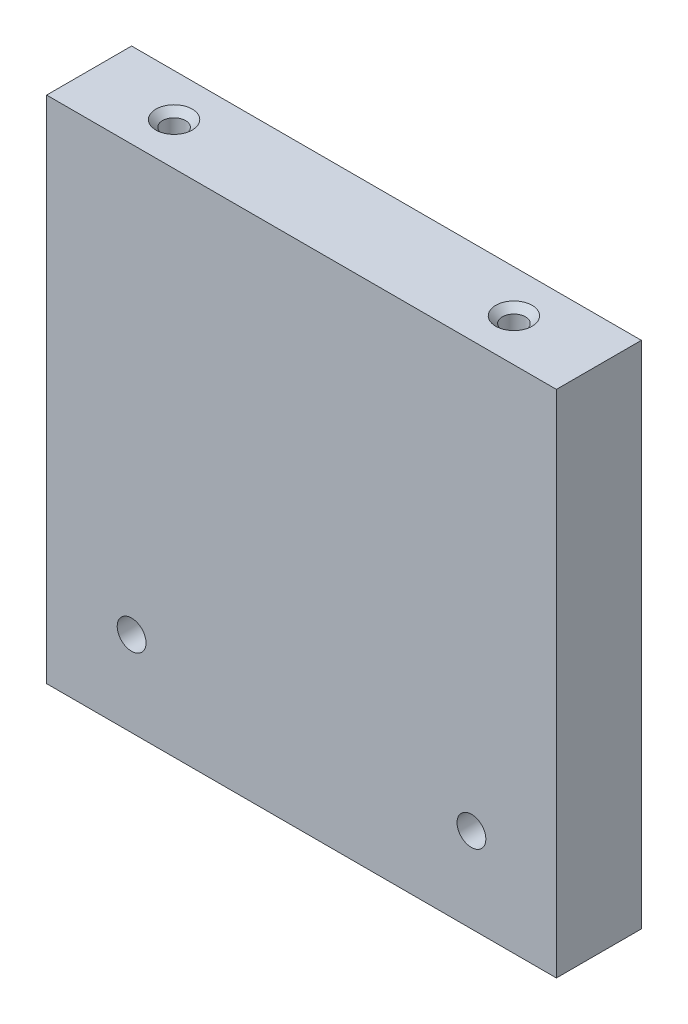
ISO-10303-21;
HEADER;
FILE_DESCRIPTION(('STEP AP214'),'2;1');
FILE_NAME('part.step','',(''),(''),'','','');
FILE_SCHEMA(('AUTOMOTIVE_DESIGN { 1 0 10303 214 1 1 1 1 }'));
ENDSEC;
DATA;
#1=APPLICATION_CONTEXT('core data for automotive mechanical design processes');
#2=APPLICATION_PROTOCOL_DEFINITION('international standard','automotive_design',2000,#1);
#3=PRODUCT_CONTEXT('',#1,'mechanical');
#4=PRODUCT('Part','Part','',(#3));
#5=PRODUCT_RELATED_PRODUCT_CATEGORY('part','',(#4));
#6=PRODUCT_DEFINITION_FORMATION('','',#4);
#7=PRODUCT_DEFINITION_CONTEXT('part definition',#1,'design');
#8=PRODUCT_DEFINITION('design','',#6,#7);
#9=PRODUCT_DEFINITION_SHAPE('','',#8);
#10=(LENGTH_UNIT() NAMED_UNIT(*) SI_UNIT(.MILLI.,.METRE.));
#11=(NAMED_UNIT(*) PLANE_ANGLE_UNIT() SI_UNIT($,.RADIAN.));
#12=(NAMED_UNIT(*) SI_UNIT($,.STERADIAN.) SOLID_ANGLE_UNIT());
#13=UNCERTAINTY_MEASURE_WITH_UNIT(LENGTH_MEASURE(1.E-05),#10,'distance_accuracy_value','');
#14=(GEOMETRIC_REPRESENTATION_CONTEXT(3) GLOBAL_UNCERTAINTY_ASSIGNED_CONTEXT((#13)) GLOBAL_UNIT_ASSIGNED_CONTEXT((#10,
#11,#12)) REPRESENTATION_CONTEXT('',''));
#15=CARTESIAN_POINT('',(0.,0.,0.));
#16=DIRECTION('',(0.,0.,1.));
#17=DIRECTION('',(1.,0.,0.));
#18=AXIS2_PLACEMENT_3D('',#15,#16,#17);
#19=CARTESIAN_POINT('',(-83.6106791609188,-14.4887323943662,12.7));
#20=DIRECTION('',(0.,1.,0.));
#21=DIRECTION('',(0.,0.,1.));
#22=AXIS2_PLACEMENT_3D('',#19,#20,#21);
#23=PLANE('',#22);
#24=DIRECTION('',(1.,0.,0.));
#25=VECTOR('',#24,1.);
#26=CARTESIAN_POINT('',(-83.6106791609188,-14.4887323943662,0.));
#27=LINE('',#26,#25);
#28=CARTESIAN_POINT('',(-83.6106791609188,-14.4887323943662,0.));
#29=VERTEX_POINT('',#28);
#30=CARTESIAN_POINT('',(-7.41067916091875,-14.4887323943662,0.));
#31=VERTEX_POINT('',#30);
#32=EDGE_CURVE('E124',#29,#31,#27,.T.);
#33=ORIENTED_EDGE('',*,*,#32,.T.);
#34=DIRECTION('',(0.,0.,-1.));
#35=VECTOR('',#34,1.);
#36=CARTESIAN_POINT('',(-7.41067916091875,-14.4887323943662,12.7));
#37=LINE('',#36,#35);
#38=CARTESIAN_POINT('',(-7.41067916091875,-14.4887323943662,12.7));
#39=VERTEX_POINT('',#38);
#40=EDGE_CURVE('E11',#39,#31,#37,.T.);
#41=ORIENTED_EDGE('',*,*,#40,.F.);
#42=DIRECTION('',(1.,0.,0.));
#43=VECTOR('',#42,1.);
#44=CARTESIAN_POINT('',(-83.6106791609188,-14.4887323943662,12.7));
#45=LINE('',#44,#43);
#46=CARTESIAN_POINT('',(-83.6106791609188,-14.4887323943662,12.7));
#47=VERTEX_POINT('',#46);
#48=EDGE_CURVE('E83',#47,#39,#45,.T.);
#49=ORIENTED_EDGE('',*,*,#48,.F.);
#50=DIRECTION('',(0.,0.,-1.));
#51=VECTOR('',#50,1.);
#52=CARTESIAN_POINT('',(-83.6106791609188,-14.4887323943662,12.7));
#53=LINE('',#52,#51);
#54=EDGE_CURVE('E137',#47,#29,#53,.T.);
#55=ORIENTED_EDGE('',*,*,#54,.T.);
#56=EDGE_LOOP('',(#33,#41,#49,#55));
#57=FACE_BOUND('',#56,.T.);
#58=ADVANCED_FACE('F42',(#57),#23,.F.);
#59=CARTESIAN_POINT('',(-7.41067916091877,61.7112676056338,12.7));
#60=DIRECTION('',(1.,0.,0.));
#61=DIRECTION('',(0.,1.,0.));
#62=AXIS2_PLACEMENT_3D('',#59,#60,#61);
#63=PLANE('',#62);
#64=DIRECTION('',(0.,-1.,0.));
#65=VECTOR('',#64,1.);
#66=CARTESIAN_POINT('',(-7.41067916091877,61.7112676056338,0.));
#67=LINE('',#66,#65);
#68=CARTESIAN_POINT('',(-7.41067916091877,61.7112676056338,0.));
#69=VERTEX_POINT('',#68);
#70=EDGE_CURVE('E141',#69,#31,#67,.T.);
#71=ORIENTED_EDGE('',*,*,#70,.F.);
#72=DIRECTION('',(0.,0.,-1.));
#73=VECTOR('',#72,1.);
#74=CARTESIAN_POINT('',(-7.41067916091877,61.7112676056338,12.7));
#75=LINE('',#74,#73);
#76=CARTESIAN_POINT('',(-7.41067916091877,61.7112676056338,12.7));
#77=VERTEX_POINT('',#76);
#78=EDGE_CURVE('E51',#77,#69,#75,.T.);
#79=ORIENTED_EDGE('',*,*,#78,.F.);
#80=DIRECTION('',(0.,-1.,0.));
#81=VECTOR('',#80,1.);
#82=CARTESIAN_POINT('',(-7.41067916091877,61.7112676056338,12.7));
#83=LINE('',#82,#81);
#84=EDGE_CURVE('E127',#77,#39,#83,.T.);
#85=ORIENTED_EDGE('',*,*,#84,.T.);
#86=ORIENTED_EDGE('',*,*,#40,.T.);
#87=EDGE_LOOP('',(#71,#79,#85,#86));
#88=FACE_BOUND('',#87,.T.);
#89=ADVANCED_FACE('F161',(#88),#63,.T.);
#90=CARTESIAN_POINT('',(-83.6106791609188,61.7112676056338,12.7));
#91=DIRECTION('',(0.,1.,0.));
#92=DIRECTION('',(0.,0.,1.));
#93=AXIS2_PLACEMENT_3D('',#90,#91,#92);
#94=PLANE('',#93);
#95=CARTESIAN_POINT('',(-70.9106791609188,61.7112676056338,6.35));
#96=DIRECTION('',(0.,1.,0.));
#97=DIRECTION('',(0.,0.,1.));
#98=AXIS2_PLACEMENT_3D('',#95,#96,#97);
#99=CIRCLE('',#98,2.71780000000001);
#100=CARTESIAN_POINT('',(-70.9106791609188,61.7112676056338,9.06780000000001));
#101=VERTEX_POINT('',#100);
#102=EDGE_CURVE('E113',#101,#101,#99,.T.);
#103=ORIENTED_EDGE('',*,*,#102,.F.);
#104=EDGE_LOOP('',(#103));
#105=FACE_BOUND('',#104,.T.);
#106=CARTESIAN_POINT('',(-20.1106791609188,61.7112676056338,6.35));
#107=DIRECTION('',(0.,1.,0.));
#108=DIRECTION('',(0.,0.,1.));
#109=AXIS2_PLACEMENT_3D('',#106,#107,#108);
#110=CIRCLE('',#109,2.7178);
#111=CARTESIAN_POINT('',(-20.1106791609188,61.7112676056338,9.0678));
#112=VERTEX_POINT('',#111);
#113=EDGE_CURVE('E103',#112,#112,#110,.T.);
#114=ORIENTED_EDGE('',*,*,#113,.F.);
#115=EDGE_LOOP('',(#114));
#116=FACE_BOUND('',#115,.T.);
#117=DIRECTION('',(1.,0.,0.));
#118=VECTOR('',#117,1.);
#119=CARTESIAN_POINT('',(-83.6106791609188,61.7112676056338,0.));
#120=LINE('',#119,#118);
#121=CARTESIAN_POINT('',(-83.6106791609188,61.7112676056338,0.));
#122=VERTEX_POINT('',#121);
#123=EDGE_CURVE('E145',#122,#69,#120,.T.);
#124=ORIENTED_EDGE('',*,*,#123,.F.);
#125=DIRECTION('',(0.,0.,-1.));
#126=VECTOR('',#125,1.);
#127=CARTESIAN_POINT('',(-83.6106791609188,61.7112676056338,12.7));
#128=LINE('',#127,#126);
#129=CARTESIAN_POINT('',(-83.6106791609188,61.7112676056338,12.7));
#130=VERTEX_POINT('',#129);
#131=EDGE_CURVE('E75',#130,#122,#128,.T.);
#132=ORIENTED_EDGE('',*,*,#131,.F.);
#133=DIRECTION('',(1.,0.,0.));
#134=VECTOR('',#133,1.);
#135=CARTESIAN_POINT('',(-83.6106791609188,61.7112676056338,12.7));
#136=LINE('',#135,#134);
#137=EDGE_CURVE('E131',#130,#77,#136,.T.);
#138=ORIENTED_EDGE('',*,*,#137,.T.);
#139=ORIENTED_EDGE('',*,*,#78,.T.);
#140=EDGE_LOOP('',(#124,#132,#138,#139));
#141=FACE_BOUND('',#140,.T.);
#142=ADVANCED_FACE('F159',(#105,#116,#141),#94,.T.);
#143=CARTESIAN_POINT('',(-83.6106791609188,61.7112676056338,12.7));
#144=DIRECTION('',(1.,0.,0.));
#145=DIRECTION('',(0.,0.,-1.));
#146=AXIS2_PLACEMENT_3D('',#143,#144,#145);
#147=PLANE('',#146);
#148=DIRECTION('',(0.,-1.,0.));
#149=VECTOR('',#148,1.);
#150=CARTESIAN_POINT('',(-83.6106791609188,61.7112676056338,0.));
#151=LINE('',#150,#149);
#152=EDGE_CURVE('E78',#122,#29,#151,.T.);
#153=ORIENTED_EDGE('',*,*,#152,.T.);
#154=ORIENTED_EDGE('',*,*,#54,.F.);
#155=DIRECTION('',(0.,-1.,0.));
#156=VECTOR('',#155,1.);
#157=CARTESIAN_POINT('',(-83.6106791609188,61.7112676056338,12.7));
#158=LINE('',#157,#156);
#159=EDGE_CURVE('E59',#130,#47,#158,.T.);
#160=ORIENTED_EDGE('',*,*,#159,.F.);
#161=ORIENTED_EDGE('',*,*,#131,.T.);
#162=EDGE_LOOP('',(#153,#154,#160,#161));
#163=FACE_BOUND('',#162,.T.);
#164=ADVANCED_FACE('F166',(#163),#147,.F.);
#165=CARTESIAN_POINT('',(0.,0.,12.7));
#166=DIRECTION('',(0.,0.,-1.));
#167=DIRECTION('',(-1.,0.,0.));
#168=AXIS2_PLACEMENT_3D('',#165,#166,#167);
#169=PLANE('',#168);
#170=CARTESIAN_POINT('',(-20.1106791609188,-1.78873239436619,12.7));
#171=DIRECTION('',(0.,0.,-1.));
#172=DIRECTION('',(-1.,0.,0.));
#173=AXIS2_PLACEMENT_3D('',#170,#171,#172);
#174=CIRCLE('',#173,2.15265);
#175=CARTESIAN_POINT('',(-22.2633291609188,-1.78873239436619,12.7));
#176=VERTEX_POINT('',#175);
#177=EDGE_CURVE('E442',#176,#176,#174,.T.);
#178=ORIENTED_EDGE('',*,*,#177,.T.);
#179=EDGE_LOOP('',(#178));
#180=FACE_BOUND('',#179,.T.);
#181=CARTESIAN_POINT('',(-70.9106791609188,-1.78873239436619,12.7));
#182=DIRECTION('',(0.,0.,-1.));
#183=DIRECTION('',(-1.,0.,0.));
#184=AXIS2_PLACEMENT_3D('',#181,#182,#183);
#185=CIRCLE('',#184,2.15264999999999);
#186=CARTESIAN_POINT('',(-73.0633291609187,-1.78873239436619,12.7));
#187=VERTEX_POINT('',#186);
#188=EDGE_CURVE('E461',#187,#187,#185,.T.);
#189=ORIENTED_EDGE('',*,*,#188,.T.);
#190=EDGE_LOOP('',(#189));
#191=FACE_BOUND('',#190,.T.);
#192=ORIENTED_EDGE('',*,*,#48,.T.);
#193=ORIENTED_EDGE('',*,*,#84,.F.);
#194=ORIENTED_EDGE('',*,*,#137,.F.);
#195=ORIENTED_EDGE('',*,*,#159,.T.);
#196=EDGE_LOOP('',(#192,#193,#194,#195));
#197=FACE_BOUND('',#196,.T.);
#198=ADVANCED_FACE('F167',(#180,#191,#197),#169,.F.);
#199=CARTESIAN_POINT('',(0.,0.,0.));
#200=DIRECTION('',(0.,0.,-1.));
#201=DIRECTION('',(-1.,0.,0.));
#202=AXIS2_PLACEMENT_3D('',#199,#200,#201);
#203=PLANE('',#202);
#204=CARTESIAN_POINT('',(-20.1106791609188,-1.78873239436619,0.));
#205=DIRECTION('',(0.,0.,-1.));
#206=DIRECTION('',(-1.,0.,0.));
#207=AXIS2_PLACEMENT_3D('',#204,#205,#206);
#208=CIRCLE('',#207,4.60375);
#209=CARTESIAN_POINT('',(-24.7144291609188,-1.78873239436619,0.));
#210=VERTEX_POINT('',#209);
#211=EDGE_CURVE('E427',#210,#210,#208,.T.);
#212=ORIENTED_EDGE('',*,*,#211,.F.);
#213=EDGE_LOOP('',(#212));
#214=FACE_BOUND('',#213,.T.);
#215=CARTESIAN_POINT('',(-70.9106791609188,-1.78873239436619,0.));
#216=DIRECTION('',(0.,0.,-1.));
#217=DIRECTION('',(-1.,0.,0.));
#218=AXIS2_PLACEMENT_3D('',#215,#216,#217);
#219=CIRCLE('',#218,4.60375);
#220=CARTESIAN_POINT('',(-75.5144291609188,-1.78873239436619,0.));
#221=VERTEX_POINT('',#220);
#222=EDGE_CURVE('E445',#221,#221,#219,.T.);
#223=ORIENTED_EDGE('',*,*,#222,.F.);
#224=EDGE_LOOP('',(#223));
#225=FACE_BOUND('',#224,.T.);
#226=ORIENTED_EDGE('',*,*,#32,.F.);
#227=ORIENTED_EDGE('',*,*,#152,.F.);
#228=ORIENTED_EDGE('',*,*,#123,.T.);
#229=ORIENTED_EDGE('',*,*,#70,.T.);
#230=EDGE_LOOP('',(#226,#227,#228,#229));
#231=FACE_BOUND('',#230,.T.);
#232=ADVANCED_FACE('F164',(#214,#225,#231),#203,.T.);
#233=CARTESIAN_POINT('',(-20.1106791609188,55.3612676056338,6.35));
#234=DIRECTION('',(0.,1.,0.));
#235=DIRECTION('',(0.,0.,1.));
#236=AXIS2_PLACEMENT_3D('',#233,#234,#235);
#237=CONICAL_SURFACE('',#236,1.7272,1.02974425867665);
#238=CARTESIAN_POINT('',(-20.1106791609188,54.3234611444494,6.35));
#239=VERTEX_POINT('',#238);
#240=VERTEX_LOOP('',#239);
#241=FACE_BOUND('',#240,.T.);
#242=CARTESIAN_POINT('',(-20.1106791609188,55.3612676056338,6.35));
#243=DIRECTION('',(0.,1.,0.));
#244=DIRECTION('',(0.,0.,1.));
#245=AXIS2_PLACEMENT_3D('',#242,#243,#244);
#246=CIRCLE('',#245,1.7272);
#247=CARTESIAN_POINT('',(-20.1106791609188,55.3612676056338,8.0772));
#248=VERTEX_POINT('',#247);
#249=EDGE_CURVE('E120',#248,#248,#246,.T.);
#250=ORIENTED_EDGE('',*,*,#249,.T.);
#251=EDGE_LOOP('',(#250));
#252=FACE_BOUND('',#251,.T.);
#253=ADVANCED_FACE('F175',(#241,#252),#237,.F.);
#254=CARTESIAN_POINT('',(-20.1106791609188,61.7112676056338,6.35));
#255=DIRECTION('',(0.,1.,0.));
#256=DIRECTION('',(0.,0.,1.));
#257=AXIS2_PLACEMENT_3D('',#254,#255,#256);
#258=CYLINDRICAL_SURFACE('',#257,1.7272);
#259=ORIENTED_EDGE('',*,*,#249,.F.);
#260=EDGE_LOOP('',(#259));
#261=FACE_BOUND('',#260,.T.);
#262=CARTESIAN_POINT('',(-20.1106791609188,60.7206676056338,6.35));
#263=DIRECTION('',(0.,1.,0.));
#264=DIRECTION('',(0.,0.,1.));
#265=AXIS2_PLACEMENT_3D('',#262,#263,#264);
#266=CIRCLE('',#265,1.7272);
#267=CARTESIAN_POINT('',(-20.1106791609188,60.7206676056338,8.0772));
#268=VERTEX_POINT('',#267);
#269=EDGE_CURVE('E110',#268,#268,#266,.T.);
#270=ORIENTED_EDGE('',*,*,#269,.T.);
#271=EDGE_LOOP('',(#270));
#272=FACE_BOUND('',#271,.T.);
#273=ADVANCED_FACE('F199',(#261,#272),#258,.F.);
#274=CARTESIAN_POINT('',(-20.1106791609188,61.7112676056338,6.35));
#275=DIRECTION('',(0.,1.,0.));
#276=DIRECTION('',(0.,0.,1.));
#277=AXIS2_PLACEMENT_3D('',#274,#275,#276);
#278=CONICAL_SURFACE('',#277,2.7178,0.785398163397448);
#279=ORIENTED_EDGE('',*,*,#269,.F.);
#280=EDGE_LOOP('',(#279));
#281=FACE_BOUND('',#280,.T.);
#282=ORIENTED_EDGE('',*,*,#113,.T.);
#283=EDGE_LOOP('',(#282));
#284=FACE_BOUND('',#283,.T.);
#285=ADVANCED_FACE('F96',(#281,#284),#278,.F.);
#286=CARTESIAN_POINT('',(-70.9106791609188,55.3612676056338,6.35));
#287=DIRECTION('',(0.,1.,0.));
#288=DIRECTION('',(0.,0.,1.));
#289=AXIS2_PLACEMENT_3D('',#286,#287,#288);
#290=CONICAL_SURFACE('',#289,1.7272,1.02974425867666);
#291=CARTESIAN_POINT('',(-70.9106791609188,54.3234611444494,6.35));
#292=VERTEX_POINT('',#291);
#293=VERTEX_LOOP('',#292);
#294=FACE_BOUND('',#293,.T.);
#295=CARTESIAN_POINT('',(-70.9106791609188,55.3612676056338,6.35));
#296=DIRECTION('',(0.,1.,0.));
#297=DIRECTION('',(0.,0.,1.));
#298=AXIS2_PLACEMENT_3D('',#295,#296,#297);
#299=CIRCLE('',#298,1.7272);
#300=CARTESIAN_POINT('',(-70.9106791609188,55.3612676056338,8.0772));
#301=VERTEX_POINT('',#300);
#302=EDGE_CURVE('E100',#301,#301,#299,.T.);
#303=ORIENTED_EDGE('',*,*,#302,.T.);
#304=EDGE_LOOP('',(#303));
#305=FACE_BOUND('',#304,.T.);
#306=ADVANCED_FACE('F92',(#294,#305),#290,.F.);
#307=CARTESIAN_POINT('',(-70.9106791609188,61.7112676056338,6.35));
#308=DIRECTION('',(0.,1.,0.));
#309=DIRECTION('',(0.,0.,1.));
#310=AXIS2_PLACEMENT_3D('',#307,#308,#309);
#311=CYLINDRICAL_SURFACE('',#310,1.7272);
#312=ORIENTED_EDGE('',*,*,#302,.F.);
#313=EDGE_LOOP('',(#312));
#314=FACE_BOUND('',#313,.T.);
#315=CARTESIAN_POINT('',(-70.9106791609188,60.7206676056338,6.35));
#316=DIRECTION('',(0.,1.,0.));
#317=DIRECTION('',(0.,0.,1.));
#318=AXIS2_PLACEMENT_3D('',#315,#316,#317);
#319=CIRCLE('',#318,1.7272);
#320=CARTESIAN_POINT('',(-70.9106791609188,60.7206676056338,8.0772));
#321=VERTEX_POINT('',#320);
#322=EDGE_CURVE('E104',#321,#321,#319,.T.);
#323=ORIENTED_EDGE('',*,*,#322,.T.);
#324=EDGE_LOOP('',(#323));
#325=FACE_BOUND('',#324,.T.);
#326=ADVANCED_FACE('F95',(#314,#325),#311,.F.);
#327=CARTESIAN_POINT('',(-70.9106791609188,61.7112676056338,6.35));
#328=DIRECTION('',(0.,1.,0.));
#329=DIRECTION('',(0.,0.,1.));
#330=AXIS2_PLACEMENT_3D('',#327,#328,#329);
#331=CONICAL_SURFACE('',#330,2.71780000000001,0.785398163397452);
#332=ORIENTED_EDGE('',*,*,#322,.F.);
#333=EDGE_LOOP('',(#332));
#334=FACE_BOUND('',#333,.T.);
#335=ORIENTED_EDGE('',*,*,#102,.T.);
#336=EDGE_LOOP('',(#335));
#337=FACE_BOUND('',#336,.T.);
#338=ADVANCED_FACE('F244',(#334,#337),#331,.F.);
#339=CARTESIAN_POINT('',(-70.9106791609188,-1.78873239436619,0.));
#340=DIRECTION('',(0.,0.,-1.));
#341=DIRECTION('',(-1.,0.,0.));
#342=AXIS2_PLACEMENT_3D('',#339,#340,#341);
#343=CYLINDRICAL_SURFACE('',#342,2.15265);
#344=ORIENTED_EDGE('',*,*,#188,.F.);
#345=EDGE_LOOP('',(#344));
#346=FACE_BOUND('',#345,.T.);
#347=CARTESIAN_POINT('',(-70.9106791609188,-1.78873239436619,4.1656));
#348=DIRECTION('',(0.,0.,-1.));
#349=DIRECTION('',(-1.,0.,0.));
#350=AXIS2_PLACEMENT_3D('',#347,#348,#349);
#351=CIRCLE('',#350,2.15265000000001);
#352=CARTESIAN_POINT('',(-73.0633291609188,-1.78873239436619,4.1656));
#353=VERTEX_POINT('',#352);
#354=EDGE_CURVE('E457',#353,#353,#351,.T.);
#355=ORIENTED_EDGE('',*,*,#354,.T.);
#356=EDGE_LOOP('',(#355));
#357=FACE_BOUND('',#356,.T.);
#358=ADVANCED_FACE('F252',(#346,#357),#343,.F.);
#359=CARTESIAN_POINT('',(-66.9419291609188,-1.78873239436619,4.1656));
#360=DIRECTION('',(0.,0.,1.));
#361=DIRECTION('',(1.,0.,0.));
#362=AXIS2_PLACEMENT_3D('',#359,#360,#361);
#363=PLANE('',#362);
#364=ORIENTED_EDGE('',*,*,#354,.F.);
#365=EDGE_LOOP('',(#364));
#366=FACE_BOUND('',#365,.T.);
#367=CARTESIAN_POINT('',(-70.9106791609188,-1.78873239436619,4.1656));
#368=DIRECTION('',(0.,0.,-1.));
#369=DIRECTION('',(-1.,0.,0.));
#370=AXIS2_PLACEMENT_3D('',#367,#368,#369);
#371=CIRCLE('',#370,3.96874999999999);
#372=CARTESIAN_POINT('',(-74.8794291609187,-1.78873239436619,4.1656));
#373=VERTEX_POINT('',#372);
#374=EDGE_CURVE('E453',#373,#373,#371,.T.);
#375=ORIENTED_EDGE('',*,*,#374,.T.);
#376=EDGE_LOOP('',(#375));
#377=FACE_BOUND('',#376,.T.);
#378=ADVANCED_FACE('F262',(#366,#377),#363,.F.);
#379=CARTESIAN_POINT('',(-70.9106791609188,-1.78873239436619,0.));
#380=DIRECTION('',(0.,0.,-1.));
#381=DIRECTION('',(-1.,0.,0.));
#382=AXIS2_PLACEMENT_3D('',#379,#380,#381);
#383=CYLINDRICAL_SURFACE('',#382,3.96874999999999);
#384=ORIENTED_EDGE('',*,*,#374,.F.);
#385=EDGE_LOOP('',(#384));
#386=FACE_BOUND('',#385,.T.);
#387=CARTESIAN_POINT('',(-70.9106791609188,-1.78873239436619,0.635));
#388=DIRECTION('',(0.,0.,-1.));
#389=DIRECTION('',(-1.,0.,0.));
#390=AXIS2_PLACEMENT_3D('',#387,#388,#389);
#391=CIRCLE('',#390,3.96874999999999);
#392=CARTESIAN_POINT('',(-74.8794291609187,-1.78873239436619,0.635));
#393=VERTEX_POINT('',#392);
#394=EDGE_CURVE('E449',#393,#393,#391,.T.);
#395=ORIENTED_EDGE('',*,*,#394,.T.);
#396=EDGE_LOOP('',(#395));
#397=FACE_BOUND('',#396,.T.);
#398=ADVANCED_FACE('F273',(#386,#397),#383,.F.);
#399=CARTESIAN_POINT('',(-70.9106791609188,-1.78873239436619,0.));
#400=DIRECTION('',(0.,0.,-1.));
#401=DIRECTION('',(-1.,0.,0.));
#402=AXIS2_PLACEMENT_3D('',#399,#400,#401);
#403=CONICAL_SURFACE('',#402,4.60375,0.785398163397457);
#404=ORIENTED_EDGE('',*,*,#394,.F.);
#405=EDGE_LOOP('',(#404));
#406=FACE_BOUND('',#405,.T.);
#407=ORIENTED_EDGE('',*,*,#222,.T.);
#408=EDGE_LOOP('',(#407));
#409=FACE_BOUND('',#408,.T.);
#410=ADVANCED_FACE('F283',(#406,#409),#403,.F.);
#411=CARTESIAN_POINT('',(-20.1106791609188,-1.78873239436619,0.));
#412=DIRECTION('',(0.,0.,-1.));
#413=DIRECTION('',(-1.,0.,0.));
#414=AXIS2_PLACEMENT_3D('',#411,#412,#413);
#415=CYLINDRICAL_SURFACE('',#414,2.15265);
#416=ORIENTED_EDGE('',*,*,#177,.F.);
#417=EDGE_LOOP('',(#416));
#418=FACE_BOUND('',#417,.T.);
#419=CARTESIAN_POINT('',(-20.1106791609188,-1.78873239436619,4.1656));
#420=DIRECTION('',(0.,0.,-1.));
#421=DIRECTION('',(-1.,0.,0.));
#422=AXIS2_PLACEMENT_3D('',#419,#420,#421);
#423=CIRCLE('',#422,2.15265);
#424=CARTESIAN_POINT('',(-22.2633291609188,-1.78873239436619,4.1656));
#425=VERTEX_POINT('',#424);
#426=EDGE_CURVE('E438',#425,#425,#423,.T.);
#427=ORIENTED_EDGE('',*,*,#426,.T.);
#428=EDGE_LOOP('',(#427));
#429=FACE_BOUND('',#428,.T.);
#430=ADVANCED_FACE('F293',(#418,#429),#415,.F.);
#431=CARTESIAN_POINT('',(-16.1419291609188,-1.78873239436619,4.1656));
#432=DIRECTION('',(0.,0.,1.));
#433=DIRECTION('',(1.,0.,0.));
#434=AXIS2_PLACEMENT_3D('',#431,#432,#433);
#435=PLANE('',#434);
#436=ORIENTED_EDGE('',*,*,#426,.F.);
#437=EDGE_LOOP('',(#436));
#438=FACE_BOUND('',#437,.T.);
#439=CARTESIAN_POINT('',(-20.1106791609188,-1.78873239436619,4.1656));
#440=DIRECTION('',(0.,0.,-1.));
#441=DIRECTION('',(-1.,0.,0.));
#442=AXIS2_PLACEMENT_3D('',#439,#440,#441);
#443=CIRCLE('',#442,3.96875);
#444=CARTESIAN_POINT('',(-24.0794291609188,-1.78873239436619,4.1656));
#445=VERTEX_POINT('',#444);
#446=EDGE_CURVE('E432',#445,#445,#443,.T.);
#447=ORIENTED_EDGE('',*,*,#446,.T.);
#448=EDGE_LOOP('',(#447));
#449=FACE_BOUND('',#448,.T.);
#450=ADVANCED_FACE('F303',(#438,#449),#435,.F.);
#451=CARTESIAN_POINT('',(-20.1106791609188,-1.78873239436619,0.));
#452=DIRECTION('',(0.,0.,-1.));
#453=DIRECTION('',(-1.,0.,0.));
#454=AXIS2_PLACEMENT_3D('',#451,#452,#453);
#455=CYLINDRICAL_SURFACE('',#454,3.96875);
#456=ORIENTED_EDGE('',*,*,#446,.F.);
#457=EDGE_LOOP('',(#456));
#458=FACE_BOUND('',#457,.T.);
#459=CARTESIAN_POINT('',(-20.1106791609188,-1.78873239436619,0.635));
#460=DIRECTION('',(0.,0.,-1.));
#461=DIRECTION('',(-1.,0.,0.));
#462=AXIS2_PLACEMENT_3D('',#459,#460,#461);
#463=CIRCLE('',#462,3.96875);
#464=CARTESIAN_POINT('',(-24.0794291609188,-1.78873239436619,0.635));
#465=VERTEX_POINT('',#464);
#466=EDGE_CURVE('E424',#465,#465,#463,.T.);
#467=ORIENTED_EDGE('',*,*,#466,.T.);
#468=EDGE_LOOP('',(#467));
#469=FACE_BOUND('',#468,.T.);
#470=ADVANCED_FACE('F313',(#458,#469),#455,.F.);
#471=CARTESIAN_POINT('',(-20.1106791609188,-1.78873239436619,0.));
#472=DIRECTION('',(0.,0.,-1.));
#473=DIRECTION('',(-1.,0.,0.));
#474=AXIS2_PLACEMENT_3D('',#471,#472,#473);
#475=CONICAL_SURFACE('',#474,4.60375,0.785398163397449);
#476=ORIENTED_EDGE('',*,*,#466,.F.);
#477=EDGE_LOOP('',(#476));
#478=FACE_BOUND('',#477,.T.);
#479=ORIENTED_EDGE('',*,*,#211,.T.);
#480=EDGE_LOOP('',(#479));
#481=FACE_BOUND('',#480,.T.);
#482=ADVANCED_FACE('F323',(#478,#481),#475,.F.);
#483=CLOSED_SHELL('',(#58,#89,#142,#164,#198,#232,#253,#273,#285,#306,#326,#338,#358,#378,#398,
#410,#430,#450,#470,#482));
#484=MANIFOLD_SOLID_BREP('B2',#483);
#485=ADVANCED_BREP_SHAPE_REPRESENTATION('',(#18,#484),#14);
#486=SHAPE_DEFINITION_REPRESENTATION(#9,#485);
ENDSEC;
END-ISO-10303-21;
